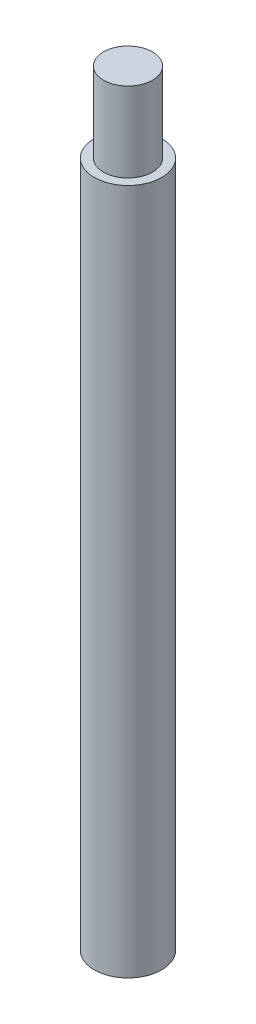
ISO-10303-21;
HEADER;
FILE_DESCRIPTION(('STEP AP214'),'2;1');
FILE_NAME('part.step','',(''),(''),'','','');
FILE_SCHEMA(('AUTOMOTIVE_DESIGN { 1 0 10303 214 1 1 1 1 }'));
ENDSEC;
DATA;
#1=APPLICATION_CONTEXT('core data for automotive mechanical design processes');
#2=APPLICATION_PROTOCOL_DEFINITION('international standard','automotive_design',2000,#1);
#3=PRODUCT_CONTEXT('',#1,'mechanical');
#4=PRODUCT('Part','Part','',(#3));
#5=PRODUCT_RELATED_PRODUCT_CATEGORY('part','',(#4));
#6=PRODUCT_DEFINITION_FORMATION('','',#4);
#7=PRODUCT_DEFINITION_CONTEXT('part definition',#1,'design');
#8=PRODUCT_DEFINITION('design','',#6,#7);
#9=PRODUCT_DEFINITION_SHAPE('','',#8);
#10=(LENGTH_UNIT() NAMED_UNIT(*) SI_UNIT(.MILLI.,.METRE.));
#11=(NAMED_UNIT(*) PLANE_ANGLE_UNIT() SI_UNIT($,.RADIAN.));
#12=(NAMED_UNIT(*) SI_UNIT($,.STERADIAN.) SOLID_ANGLE_UNIT());
#13=UNCERTAINTY_MEASURE_WITH_UNIT(LENGTH_MEASURE(1.E-05),#10,'distance_accuracy_value','');
#14=(GEOMETRIC_REPRESENTATION_CONTEXT(3) GLOBAL_UNCERTAINTY_ASSIGNED_CONTEXT((#13)) GLOBAL_UNIT_ASSIGNED_CONTEXT((#10,
#11,#12)) REPRESENTATION_CONTEXT('',''));
#15=CARTESIAN_POINT('',(0.,0.,0.));
#16=DIRECTION('',(0.,0.,1.));
#17=DIRECTION('',(1.,0.,0.));
#18=AXIS2_PLACEMENT_3D('',#15,#16,#17);
#19=CARTESIAN_POINT('',(0.,355.6,0.));
#20=DIRECTION('',(0.,1.,0.));
#21=DIRECTION('',(0.,0.,1.));
#22=AXIS2_PLACEMENT_3D('',#19,#20,#21);
#23=PLANE('',#22);
#24=CARTESIAN_POINT('',(0.,355.6,0.));
#25=DIRECTION('',(0.,1.,0.));
#26=DIRECTION('',(0.,0.,1.));
#27=AXIS2_PLACEMENT_3D('',#24,#25,#26);
#28=CIRCLE('',#27,17.4625);
#29=CARTESIAN_POINT('',(0.,355.6,17.4625));
#30=VERTEX_POINT('',#29);
#31=EDGE_CURVE('E10',#30,#30,#28,.T.);
#32=ORIENTED_EDGE('',*,*,#31,.T.);
#33=EDGE_LOOP('',(#32));
#34=FACE_BOUND('',#33,.T.);
#35=CARTESIAN_POINT('',(0.,355.6,0.));
#36=DIRECTION('',(0.,1.,0.));
#37=DIRECTION('',(0.,0.,1.));
#38=AXIS2_PLACEMENT_3D('',#35,#36,#37);
#39=CIRCLE('',#38,12.7);
#40=CARTESIAN_POINT('',(0.,355.6,12.7));
#41=VERTEX_POINT('',#40);
#42=EDGE_CURVE('E43',#41,#41,#39,.T.);
#43=ORIENTED_EDGE('',*,*,#42,.F.);
#44=EDGE_LOOP('',(#43));
#45=FACE_BOUND('',#44,.T.);
#46=ADVANCED_FACE('F28',(#34,#45),#23,.T.);
#47=CARTESIAN_POINT('',(0.,355.6,0.));
#48=DIRECTION('',(0.,-1.,0.));
#49=DIRECTION('',(0.,0.,-1.));
#50=AXIS2_PLACEMENT_3D('',#47,#48,#49);
#51=CYLINDRICAL_SURFACE('',#50,17.4625);
#52=ORIENTED_EDGE('',*,*,#31,.F.);
#53=EDGE_LOOP('',(#52));
#54=FACE_BOUND('',#53,.T.);
#55=CARTESIAN_POINT('',(0.,0.,0.));
#56=DIRECTION('',(0.,1.,0.));
#57=DIRECTION('',(0.,0.,1.));
#58=AXIS2_PLACEMENT_3D('',#55,#56,#57);
#59=CIRCLE('',#58,17.4625);
#60=CARTESIAN_POINT('',(0.,0.,17.4625));
#61=VERTEX_POINT('',#60);
#62=EDGE_CURVE('E35',#61,#61,#59,.T.);
#63=ORIENTED_EDGE('',*,*,#62,.T.);
#64=EDGE_LOOP('',(#63));
#65=FACE_BOUND('',#64,.T.);
#66=ADVANCED_FACE('F30',(#54,#65),#51,.T.);
#67=CARTESIAN_POINT('',(0.,0.,0.));
#68=DIRECTION('',(0.,1.,0.));
#69=DIRECTION('',(0.,0.,1.));
#70=AXIS2_PLACEMENT_3D('',#67,#68,#69);
#71=PLANE('',#70);
#72=ORIENTED_EDGE('',*,*,#62,.F.);
#73=EDGE_LOOP('',(#72));
#74=FACE_BOUND('',#73,.T.);
#75=ADVANCED_FACE('F57',(#74),#71,.F.);
#76=CARTESIAN_POINT('',(0.,396.875,0.));
#77=DIRECTION('',(0.,-1.,0.));
#78=DIRECTION('',(0.,0.,-1.));
#79=AXIS2_PLACEMENT_3D('',#76,#77,#78);
#80=CYLINDRICAL_SURFACE('',#79,12.7);
#81=CARTESIAN_POINT('',(0.,396.875,0.));
#82=DIRECTION('',(0.,1.,0.));
#83=DIRECTION('',(0.,0.,1.));
#84=AXIS2_PLACEMENT_3D('',#81,#82,#83);
#85=CIRCLE('',#84,12.7);
#86=CARTESIAN_POINT('',(0.,396.875,12.7));
#87=VERTEX_POINT('',#86);
#88=EDGE_CURVE('E39',#87,#87,#85,.T.);
#89=ORIENTED_EDGE('',*,*,#88,.F.);
#90=EDGE_LOOP('',(#89));
#91=FACE_BOUND('',#90,.T.);
#92=ORIENTED_EDGE('',*,*,#42,.T.);
#93=EDGE_LOOP('',(#92));
#94=FACE_BOUND('',#93,.T.);
#95=ADVANCED_FACE('F49',(#91,#94),#80,.T.);
#96=CARTESIAN_POINT('',(0.,396.875,0.));
#97=DIRECTION('',(0.,1.,0.));
#98=DIRECTION('',(0.,0.,1.));
#99=AXIS2_PLACEMENT_3D('',#96,#97,#98);
#100=PLANE('',#99);
#101=ORIENTED_EDGE('',*,*,#88,.T.);
#102=EDGE_LOOP('',(#101));
#103=FACE_BOUND('',#102,.T.);
#104=ADVANCED_FACE('F63',(#103),#100,.T.);
#105=CLOSED_SHELL('',(#46,#66,#75,#95,#104));
#106=MANIFOLD_SOLID_BREP('B2',#105);
#107=ADVANCED_BREP_SHAPE_REPRESENTATION('',(#18,#106),#14);
#108=SHAPE_DEFINITION_REPRESENTATION(#9,#107);
ENDSEC;
END-ISO-10303-21;
